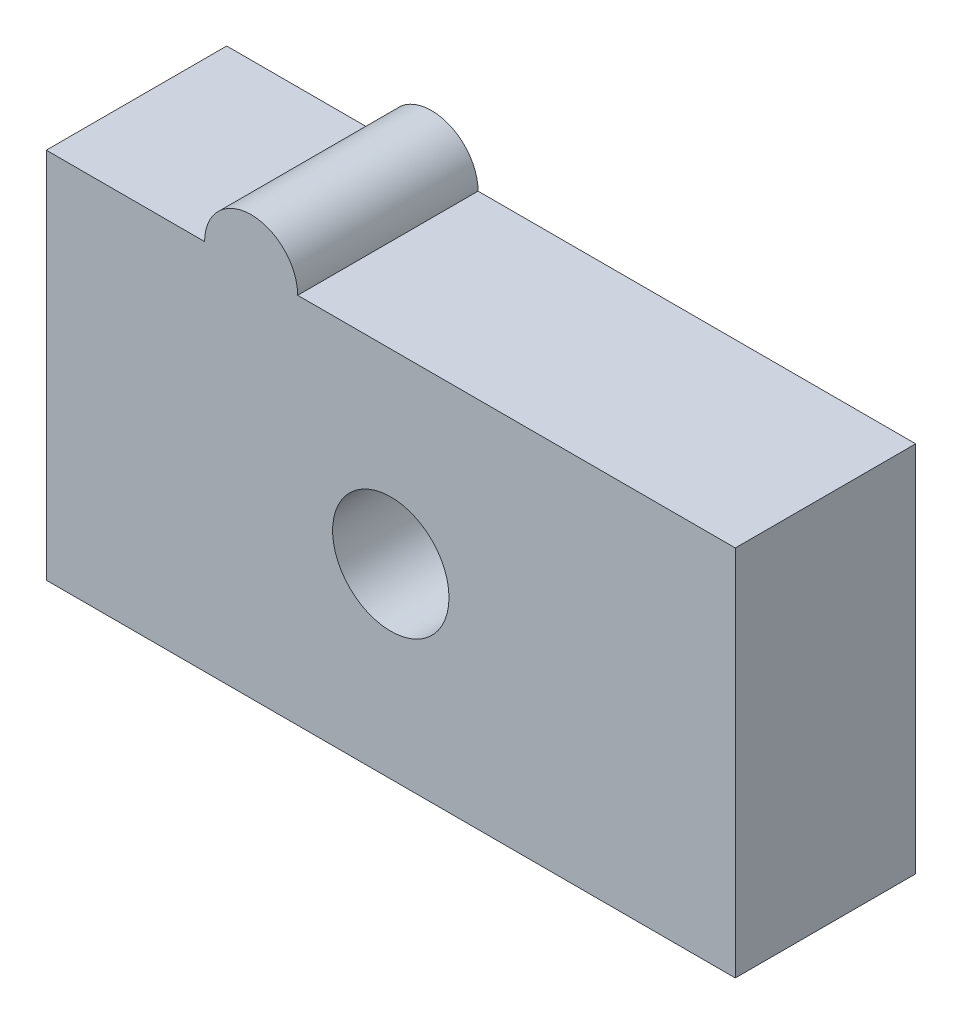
from build123d import *

# Parameters (mm, degrees)
BASE_EXTRUSION_DEPTH    = 3.875
ESQUISSE2_R             = 1
ENL_V_MAT_EXTRU_1_DEPTH = 3
ESQUISSE3_R             = 1.25
ENL_V_MAT_EXTRU_2_DEPTH = 20.843780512


with BuildPart() as part:
    # Esquisse1 → Base-Extrusion (new body)
    with BuildSketch(Plane.XY):
        with BuildLine():
            Line((-2, -10), (7.4, -10))
            Line((7.4, -10), (7.4, -18))
            Line((7.4, -18), (-7.4, -18))
            Line((-7.4, -18), (-7.4, -10))
            Line((-7.4, -10), (-4, -10))
            ThreePointArc((-4, -10), (-3, -9), (-2, -10))
        make_face()
    extrude(amount=BASE_EXTRUSION_DEPTH)

    # Esquisse2 → Enl_v. mat.-Extru.1 (cut)
    with BuildSketch(Plane(origin=(0, 0, 0), x_dir=(-1, 0, 0), z_dir=(0, 0, -1))):
        with Locations((-4.993776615, -11.695180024)):
            Circle(ESQUISSE2_R)
        with Locations((4.993776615, -16.304819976)):
            Circle(ESQUISSE2_R)
    extrude(amount=-ENL_V_MAT_EXTRU_1_DEPTH, mode=Mode.SUBTRACT)

    # Esquisse3 → Enl_v. mat.-Extru.2 (cut, through all)
    with BuildSketch(Plane.XY.offset(3.875)):
        with Locations((0, -14)):
            Circle(ESQUISSE3_R)
    extrude(amount=-ENL_V_MAT_EXTRU_2_DEPTH, mode=Mode.SUBTRACT)


solid = part.part
